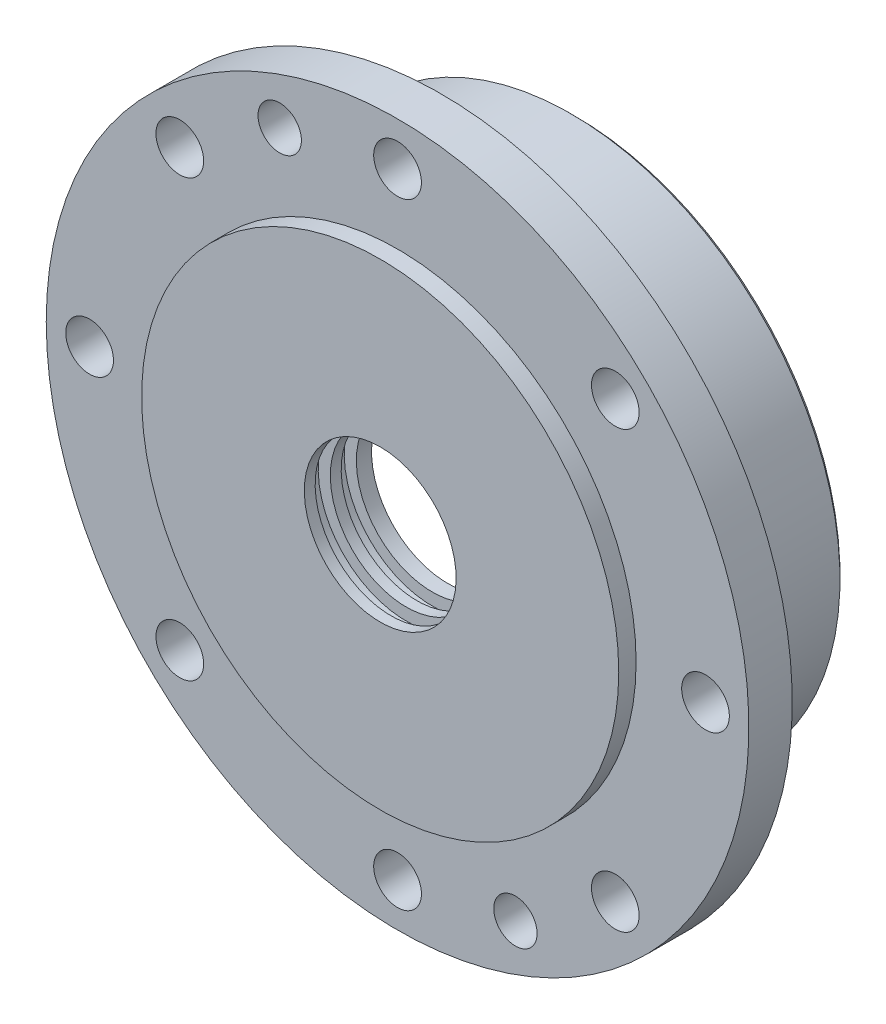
from build123d import *

# Parameters (mm, degrees)
SKETCH_1_R          = 55
EXTRUDE_1_DEPTH     = 4
SKETCH_2_R          = 81
EXTRUDE_2_DEPTH     = 10
SKETCH_3_R          = 62
EXTRUDE_3_DEPTH     = 31
SKETCH_4_W          = 9
SKETCH_4_H          = 60
SKETCH_4_W_2        = 15.5
SKETCH_4_H_2        = 57.5
SKETCH_4_W_3        = 0.5
SKETCH_4_H_3        = 50
SKETCH_5_W          = 2.5
SKETCH_5_H          = 17.5
SKETCH_6_R          = 17.5
CUT_EXTRUDE_1_DEPTH = 119.542186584
SKETCH_7_R          = 5.5
CUT_EXTRUDE_2_DEPTH = 122.667579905
SKETCH_8_R          = 5
CUT_EXTRUDE_3_DEPTH = 122.667579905
CHAMFER_1_SIZE      = 1


with BuildPart() as part:
    # Sketch 1 → Extrude 1 (new body)
    with BuildSketch(Plane.XY):
        Circle(SKETCH_1_R)
    extrude(amount=EXTRUDE_1_DEPTH)

    # Sketch 2 → Extrude 2 (add)
    with BuildSketch(Plane(origin=(0, 0, 0), x_dir=(-1, 0, 0), z_dir=(0, 0, -1))):
        Circle(SKETCH_2_R)
    extrude(amount=EXTRUDE_2_DEPTH)

    # Sketch 3 → Extrude 3 (add)
    with BuildSketch(Plane(origin=(0, 0, -10), x_dir=(-1, 0, 0), z_dir=(0, 0, -1))):
        Circle(SKETCH_3_R)
    extrude(amount=EXTRUDE_3_DEPTH)

    # Sketch 4 → Cut-Revolve 1 (revolve, cut)
    with BuildSketch(Plane(origin=(0, 0, 0), x_dir=(0, 0, -1), z_dir=(1, 0, 0)), mode=Mode.PRIVATE) as cut_revolve_1_sk:
        with Locations((36.5, 30)):
            Rectangle(SKETCH_4_W, SKETCH_4_H)
        Polygon((29, 0), (32, 0), (32, 60), (32, 60.5), (29, 60.5), (29, 57.5), align=None)
        with Locations((21.25, 28.75)):
            Rectangle(SKETCH_4_W_2, SKETCH_4_H_2)
        Polygon((12, 0), (13.5, 0), (13.5, 57.5), (13.5, 58), (12, 58), (12, 50), align=None)
        with Locations((11.75, 25)):
            Rectangle(SKETCH_4_W_3, SKETCH_4_H_3)
    revolve(cut_revolve_1_sk.sketch.rotate(Axis((0, 0, 0), (0, 0, -1)), 90), axis=Axis((0, 0, 0), (0, 0, -1)), mode=Mode.SUBTRACT)

    # Sketch 5 → Cut-Revolve 2 (revolve, cut)
    with BuildSketch(Plane(origin=(0, 0, 0), x_dir=(0, 0, -1), z_dir=(1, 0, 0))):
        with Locations((9.25, 8.75)):
            Rectangle(SKETCH_5_W, SKETCH_5_H)
        Polygon((4.5, 17.5), (4.5, 0), (8, 0), (8, 17.5), (8, 20.3), (4.5, 20.3), align=None)
        with Locations((3.25, 8.75)):
            Rectangle(SKETCH_5_W, SKETCH_5_H)
        Polygon((-1.5, 17.5), (-1.5, 0), (2, 0), (2, 17.5), (2, 20.3), (-1.5, 20.3), align=None)
        with Locations((-2.75, 8.75)):
            Rectangle(SKETCH_5_W, SKETCH_5_H)
    revolve(axis=Axis((0, 0, 0), (0, 0, 1)), mode=Mode.SUBTRACT)

    # Sketch 6 → Cut-Extrude 1 (cut, through all)
    with BuildSketch(Plane.XY.offset(-10.5)):
        with Locations(Location((0, 0, 0), (0, 0, 90))):
            Circle(SKETCH_6_R)
    extrude(amount=-CUT_EXTRUDE_1_DEPTH, mode=Mode.SUBTRACT)

    # Sketch 7 → Cut-Extrude 2 (cut, through all)
    with BuildSketch(Plane.XY):
        with Locations((0, 71)):
            Circle(SKETCH_7_R)
        with Locations((50.204581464, 50.204581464)):
            Circle(SKETCH_7_R)
        with Locations((71, 0)):
            Circle(SKETCH_7_R)
        with Locations((50.204581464, -50.204581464)):
            Circle(SKETCH_7_R)
        with Locations((0, -71)):
            Circle(SKETCH_7_R)
        with Locations((-50.204581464, -50.204581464)):
            Circle(SKETCH_7_R)
        with Locations((-71, 0)):
            Circle(SKETCH_7_R)
        with Locations((-50.204581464, 50.204581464)):
            Circle(SKETCH_7_R)
    extrude(amount=-CUT_EXTRUDE_2_DEPTH, mode=Mode.SUBTRACT)

    # Sketch 8 → Cut-Extrude 3 (cut, through all)
    with BuildSketch(Plane.XY):
        with Locations((-27.170523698, 65.595446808)):
            Circle(SKETCH_8_R)
        with Locations((27.170523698, -65.595446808)):
            Circle(SKETCH_8_R)
    extrude(amount=-CUT_EXTRUDE_3_DEPTH, mode=Mode.SUBTRACT)

    # Chamfer 1
    chamfer_1_edges = [part.edges().sort_by_distance(p)[0] for p in [
        (62, 0, -41),
    ]]
    chamfer(chamfer_1_edges, length=CHAMFER_1_SIZE)


solid = part.part
